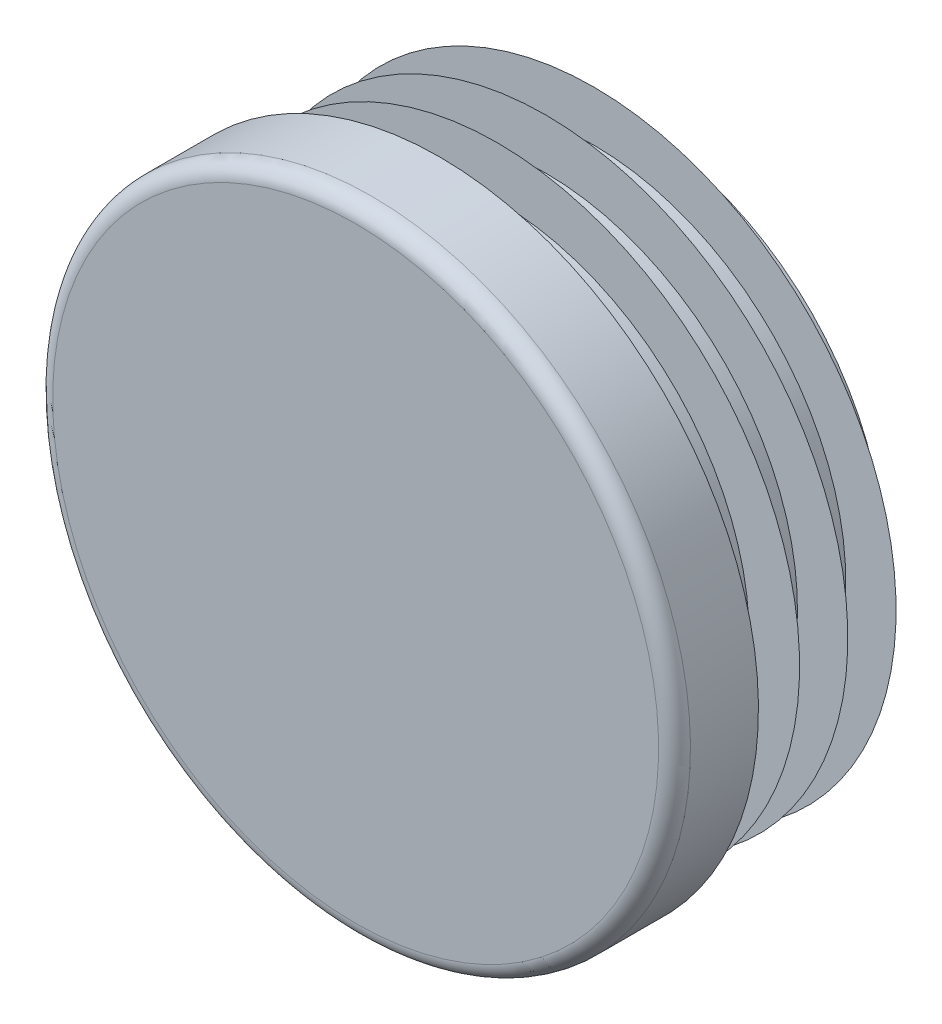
ISO-10303-21;
HEADER;
FILE_DESCRIPTION(('STEP AP214'),'2;1');
FILE_NAME('part.step','',(''),(''),'','','');
FILE_SCHEMA(('AUTOMOTIVE_DESIGN { 1 0 10303 214 1 1 1 1 }'));
ENDSEC;
DATA;
#1=APPLICATION_CONTEXT('core data for automotive mechanical design processes');
#2=APPLICATION_PROTOCOL_DEFINITION('international standard','automotive_design',2000,#1);
#3=PRODUCT_CONTEXT('',#1,'mechanical');
#4=PRODUCT('Part','Part','',(#3));
#5=PRODUCT_RELATED_PRODUCT_CATEGORY('part','',(#4));
#6=PRODUCT_DEFINITION_FORMATION('','',#4);
#7=PRODUCT_DEFINITION_CONTEXT('part definition',#1,'design');
#8=PRODUCT_DEFINITION('design','',#6,#7);
#9=PRODUCT_DEFINITION_SHAPE('','',#8);
#10=(LENGTH_UNIT() NAMED_UNIT(*) SI_UNIT(.MILLI.,.METRE.));
#11=(NAMED_UNIT(*) PLANE_ANGLE_UNIT() SI_UNIT($,.RADIAN.));
#12=(NAMED_UNIT(*) SI_UNIT($,.STERADIAN.) SOLID_ANGLE_UNIT());
#13=UNCERTAINTY_MEASURE_WITH_UNIT(LENGTH_MEASURE(1.E-05),#10,'distance_accuracy_value','');
#14=(GEOMETRIC_REPRESENTATION_CONTEXT(3) GLOBAL_UNCERTAINTY_ASSIGNED_CONTEXT((#13)) GLOBAL_UNIT_ASSIGNED_CONTEXT((#10,
#11,#12)) REPRESENTATION_CONTEXT('',''));
#15=CARTESIAN_POINT('',(0.,0.,0.));
#16=DIRECTION('',(0.,0.,1.));
#17=DIRECTION('',(1.,0.,0.));
#18=AXIS2_PLACEMENT_3D('',#15,#16,#17);
#19=CARTESIAN_POINT('',(0.,0.,5.));
#20=DIRECTION('',(0.,0.,-1.));
#21=DIRECTION('',(0.,1.,0.));
#22=AXIS2_PLACEMENT_3D('',#19,#20,#21);
#23=PLANE('',#22);
#24=CARTESIAN_POINT('',(0.,0.,5.));
#25=DIRECTION('',(0.,0.,-1.));
#26=DIRECTION('',(0.,1.,0.));
#27=AXIS2_PLACEMENT_3D('',#24,#25,#26);
#28=CIRCLE('',#27,18.05);
#29=CARTESIAN_POINT('',(0.,18.05,5.));
#30=VERTEX_POINT('',#29);
#31=EDGE_CURVE('E8',#30,#30,#28,.T.);
#32=ORIENTED_EDGE('',*,*,#31,.F.);
#33=EDGE_LOOP('',(#32));
#34=FACE_BOUND('',#33,.T.);
#35=ADVANCED_FACE('F12',(#34),#23,.F.);
#36=CARTESIAN_POINT('',(0.,0.,4.05));
#37=DIRECTION('',(0.,0.,-1.));
#38=DIRECTION('',(0.,1.,0.));
#39=AXIS2_PLACEMENT_3D('',#36,#37,#38);
#40=TOROIDAL_SURFACE('',#39,18.05,0.95);
#41=ORIENTED_EDGE('',*,*,#31,.T.);
#42=EDGE_LOOP('',(#41));
#43=FACE_BOUND('',#42,.T.);
#44=CARTESIAN_POINT('',(0.,0.,4.05));
#45=DIRECTION('',(0.,0.,-1.));
#46=DIRECTION('',(0.,1.,0.));
#47=AXIS2_PLACEMENT_3D('',#44,#45,#46);
#48=CIRCLE('',#47,19.);
#49=CARTESIAN_POINT('',(0.,19.,4.05));
#50=VERTEX_POINT('',#49);
#51=EDGE_CURVE('E18',#50,#50,#48,.T.);
#52=ORIENTED_EDGE('',*,*,#51,.F.);
#53=EDGE_LOOP('',(#52));
#54=FACE_BOUND('',#53,.T.);
#55=ADVANCED_FACE('F159',(#43,#54),#40,.T.);
#56=CARTESIAN_POINT('',(0.,0.,-11.5));
#57=DIRECTION('',(0.,0.,-1.));
#58=DIRECTION('',(0.,1.,0.));
#59=AXIS2_PLACEMENT_3D('',#56,#57,#58);
#60=CYLINDRICAL_SURFACE('',#59,19.);
#61=CARTESIAN_POINT('',(0.,0.,0.));
#62=DIRECTION('',(0.,0.,-1.));
#63=DIRECTION('',(0.,1.,0.));
#64=AXIS2_PLACEMENT_3D('',#61,#62,#63);
#65=CIRCLE('',#64,19.);
#66=CARTESIAN_POINT('',(0.,19.,0.));
#67=VERTEX_POINT('',#66);
#68=EDGE_CURVE('E22',#67,#67,#65,.T.);
#69=ORIENTED_EDGE('',*,*,#68,.F.);
#70=EDGE_LOOP('',(#69));
#71=FACE_BOUND('',#70,.T.);
#72=ORIENTED_EDGE('',*,*,#51,.T.);
#73=EDGE_LOOP('',(#72));
#74=FACE_BOUND('',#73,.T.);
#75=ADVANCED_FACE('F154',(#71,#74),#60,.T.);
#76=CARTESIAN_POINT('',(19.,0.,0.));
#77=DIRECTION('',(0.,0.,1.));
#78=DIRECTION('',(0.,-1.,0.));
#79=AXIS2_PLACEMENT_3D('',#76,#77,#78);
#80=PLANE('',#79);
#81=CARTESIAN_POINT('',(0.,0.,0.));
#82=DIRECTION('',(0.,0.,-1.));
#83=DIRECTION('',(0.,1.,0.));
#84=AXIS2_PLACEMENT_3D('',#81,#82,#83);
#85=CIRCLE('',#84,15.);
#86=CARTESIAN_POINT('',(0.,15.,0.));
#87=VERTEX_POINT('',#86);
#88=EDGE_CURVE('E26',#87,#87,#85,.T.);
#89=ORIENTED_EDGE('',*,*,#88,.F.);
#90=EDGE_LOOP('',(#89));
#91=FACE_BOUND('',#90,.T.);
#92=ORIENTED_EDGE('',*,*,#68,.T.);
#93=EDGE_LOOP('',(#92));
#94=FACE_BOUND('',#93,.T.);
#95=ADVANCED_FACE('F148',(#91,#94),#80,.F.);
#96=CARTESIAN_POINT('',(0.,0.,-11.5));
#97=DIRECTION('',(0.,0.,-1.));
#98=DIRECTION('',(0.,1.,0.));
#99=AXIS2_PLACEMENT_3D('',#96,#97,#98);
#100=CYLINDRICAL_SURFACE('',#99,15.);
#101=CARTESIAN_POINT('',(0.,0.,-0.575));
#102=DIRECTION('',(0.,0.,-1.));
#103=DIRECTION('',(0.,1.,0.));
#104=AXIS2_PLACEMENT_3D('',#101,#102,#103);
#105=CIRCLE('',#104,15.);
#106=CARTESIAN_POINT('',(0.,15.,-0.575));
#107=VERTEX_POINT('',#106);
#108=EDGE_CURVE('E31',#107,#107,#105,.T.);
#109=ORIENTED_EDGE('',*,*,#108,.F.);
#110=EDGE_LOOP('',(#109));
#111=FACE_BOUND('',#110,.T.);
#112=ORIENTED_EDGE('',*,*,#88,.T.);
#113=EDGE_LOOP('',(#112));
#114=FACE_BOUND('',#113,.T.);
#115=ADVANCED_FACE('F142',(#111,#114),#100,.T.);
#116=CARTESIAN_POINT('',(15.,0.,-0.575));
#117=DIRECTION('',(0.,0.,-1.));
#118=DIRECTION('',(0.,1.,0.));
#119=AXIS2_PLACEMENT_3D('',#116,#117,#118);
#120=PLANE('',#119);
#121=CARTESIAN_POINT('',(0.,0.,-0.575));
#122=DIRECTION('',(0.,0.,-1.));
#123=DIRECTION('',(0.,1.,0.));
#124=AXIS2_PLACEMENT_3D('',#121,#122,#123);
#125=CIRCLE('',#124,18.);
#126=CARTESIAN_POINT('',(0.,18.,-0.575));
#127=VERTEX_POINT('',#126);
#128=EDGE_CURVE('E34',#127,#127,#125,.T.);
#129=ORIENTED_EDGE('',*,*,#128,.F.);
#130=EDGE_LOOP('',(#129));
#131=FACE_BOUND('',#130,.T.);
#132=ORIENTED_EDGE('',*,*,#108,.T.);
#133=EDGE_LOOP('',(#132));
#134=FACE_BOUND('',#133,.T.);
#135=ADVANCED_FACE('F136',(#131,#134),#120,.F.);
#136=CARTESIAN_POINT('',(0.,0.,-0.575));
#137=DIRECTION('',(0.,0.,1.));
#138=DIRECTION('',(0.,-1.,0.));
#139=AXIS2_PLACEMENT_3D('',#136,#137,#138);
#140=CONICAL_SURFACE('',#139,18.,0.959931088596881);
#141=CARTESIAN_POINT('',(0.,0.,-2.67562261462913));
#142=DIRECTION('',(0.,0.,-1.));
#143=DIRECTION('',(0.,1.,0.));
#144=AXIS2_PLACEMENT_3D('',#141,#142,#143);
#145=CIRCLE('',#144,15.);
#146=CARTESIAN_POINT('',(0.,15.,-2.67562261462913));
#147=VERTEX_POINT('',#146);
#148=EDGE_CURVE('E37',#147,#147,#145,.T.);
#149=ORIENTED_EDGE('',*,*,#148,.F.);
#150=EDGE_LOOP('',(#149));
#151=FACE_BOUND('',#150,.T.);
#152=ORIENTED_EDGE('',*,*,#128,.T.);
#153=EDGE_LOOP('',(#152));
#154=FACE_BOUND('',#153,.T.);
#155=ADVANCED_FACE('F130',(#151,#154),#140,.T.);
#156=CARTESIAN_POINT('',(0.,0.,-11.5));
#157=DIRECTION('',(0.,0.,-1.));
#158=DIRECTION('',(0.,1.,0.));
#159=AXIS2_PLACEMENT_3D('',#156,#157,#158);
#160=CYLINDRICAL_SURFACE('',#159,15.);
#161=CARTESIAN_POINT('',(0.,0.,-3.45));
#162=DIRECTION('',(0.,0.,-1.));
#163=DIRECTION('',(0.,1.,0.));
#164=AXIS2_PLACEMENT_3D('',#161,#162,#163);
#165=CIRCLE('',#164,15.);
#166=CARTESIAN_POINT('',(0.,15.,-3.45));
#167=VERTEX_POINT('',#166);
#168=EDGE_CURVE('E40',#167,#167,#165,.T.);
#169=ORIENTED_EDGE('',*,*,#168,.F.);
#170=EDGE_LOOP('',(#169));
#171=FACE_BOUND('',#170,.T.);
#172=ORIENTED_EDGE('',*,*,#148,.T.);
#173=EDGE_LOOP('',(#172));
#174=FACE_BOUND('',#173,.T.);
#175=ADVANCED_FACE('F124',(#171,#174),#160,.T.);
#176=CARTESIAN_POINT('',(15.,0.,-3.45));
#177=DIRECTION('',(0.,0.,-1.));
#178=DIRECTION('',(0.,1.,0.));
#179=AXIS2_PLACEMENT_3D('',#176,#177,#178);
#180=PLANE('',#179);
#181=CARTESIAN_POINT('',(0.,0.,-3.45));
#182=DIRECTION('',(0.,0.,-1.));
#183=DIRECTION('',(0.,1.,0.));
#184=AXIS2_PLACEMENT_3D('',#181,#182,#183);
#185=CIRCLE('',#184,18.);
#186=CARTESIAN_POINT('',(0.,18.,-3.45));
#187=VERTEX_POINT('',#186);
#188=EDGE_CURVE('E43',#187,#187,#185,.T.);
#189=ORIENTED_EDGE('',*,*,#188,.F.);
#190=EDGE_LOOP('',(#189));
#191=FACE_BOUND('',#190,.T.);
#192=ORIENTED_EDGE('',*,*,#168,.T.);
#193=EDGE_LOOP('',(#192));
#194=FACE_BOUND('',#193,.T.);
#195=ADVANCED_FACE('F118',(#191,#194),#180,.F.);
#196=CARTESIAN_POINT('',(0.,0.,-3.45));
#197=DIRECTION('',(0.,0.,1.));
#198=DIRECTION('',(0.,-1.,0.));
#199=AXIS2_PLACEMENT_3D('',#196,#197,#198);
#200=CONICAL_SURFACE('',#199,18.,0.959931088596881);
#201=CARTESIAN_POINT('',(0.,0.,-5.55062261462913));
#202=DIRECTION('',(0.,0.,-1.));
#203=DIRECTION('',(0.,1.,0.));
#204=AXIS2_PLACEMENT_3D('',#201,#202,#203);
#205=CIRCLE('',#204,15.);
#206=CARTESIAN_POINT('',(0.,15.,-5.55062261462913));
#207=VERTEX_POINT('',#206);
#208=EDGE_CURVE('E46',#207,#207,#205,.T.);
#209=ORIENTED_EDGE('',*,*,#208,.F.);
#210=EDGE_LOOP('',(#209));
#211=FACE_BOUND('',#210,.T.);
#212=ORIENTED_EDGE('',*,*,#188,.T.);
#213=EDGE_LOOP('',(#212));
#214=FACE_BOUND('',#213,.T.);
#215=ADVANCED_FACE('F112',(#211,#214),#200,.T.);
#216=CARTESIAN_POINT('',(0.,0.,-11.5));
#217=DIRECTION('',(0.,0.,-1.));
#218=DIRECTION('',(0.,1.,0.));
#219=AXIS2_PLACEMENT_3D('',#216,#217,#218);
#220=CYLINDRICAL_SURFACE('',#219,15.);
#221=CARTESIAN_POINT('',(0.,0.,-6.325));
#222=DIRECTION('',(0.,0.,-1.));
#223=DIRECTION('',(0.,1.,0.));
#224=AXIS2_PLACEMENT_3D('',#221,#222,#223);
#225=CIRCLE('',#224,15.);
#226=CARTESIAN_POINT('',(0.,15.,-6.325));
#227=VERTEX_POINT('',#226);
#228=EDGE_CURVE('E49',#227,#227,#225,.T.);
#229=ORIENTED_EDGE('',*,*,#228,.F.);
#230=EDGE_LOOP('',(#229));
#231=FACE_BOUND('',#230,.T.);
#232=ORIENTED_EDGE('',*,*,#208,.T.);
#233=EDGE_LOOP('',(#232));
#234=FACE_BOUND('',#233,.T.);
#235=ADVANCED_FACE('F106',(#231,#234),#220,.T.);
#236=CARTESIAN_POINT('',(15.,0.,-6.325));
#237=DIRECTION('',(0.,0.,-1.));
#238=DIRECTION('',(0.,1.,0.));
#239=AXIS2_PLACEMENT_3D('',#236,#237,#238);
#240=PLANE('',#239);
#241=CARTESIAN_POINT('',(0.,0.,-6.325));
#242=DIRECTION('',(0.,0.,-1.));
#243=DIRECTION('',(0.,1.,0.));
#244=AXIS2_PLACEMENT_3D('',#241,#242,#243);
#245=CIRCLE('',#244,18.);
#246=CARTESIAN_POINT('',(0.,18.,-6.325));
#247=VERTEX_POINT('',#246);
#248=EDGE_CURVE('E52',#247,#247,#245,.T.);
#249=ORIENTED_EDGE('',*,*,#248,.F.);
#250=EDGE_LOOP('',(#249));
#251=FACE_BOUND('',#250,.T.);
#252=ORIENTED_EDGE('',*,*,#228,.T.);
#253=EDGE_LOOP('',(#252));
#254=FACE_BOUND('',#253,.T.);
#255=ADVANCED_FACE('F100',(#251,#254),#240,.F.);
#256=CARTESIAN_POINT('',(0.,0.,-6.325));
#257=DIRECTION('',(0.,0.,1.));
#258=DIRECTION('',(0.,-1.,0.));
#259=AXIS2_PLACEMENT_3D('',#256,#257,#258);
#260=CONICAL_SURFACE('',#259,18.,0.959931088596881);
#261=CARTESIAN_POINT('',(0.,0.,-8.42562261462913));
#262=DIRECTION('',(0.,0.,-1.));
#263=DIRECTION('',(0.,1.,0.));
#264=AXIS2_PLACEMENT_3D('',#261,#262,#263);
#265=CIRCLE('',#264,15.);
#266=CARTESIAN_POINT('',(0.,15.,-8.42562261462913));
#267=VERTEX_POINT('',#266);
#268=EDGE_CURVE('E55',#267,#267,#265,.T.);
#269=ORIENTED_EDGE('',*,*,#268,.F.);
#270=EDGE_LOOP('',(#269));
#271=FACE_BOUND('',#270,.T.);
#272=ORIENTED_EDGE('',*,*,#248,.T.);
#273=EDGE_LOOP('',(#272));
#274=FACE_BOUND('',#273,.T.);
#275=ADVANCED_FACE('F94',(#271,#274),#260,.T.);
#276=CARTESIAN_POINT('',(0.,0.,-11.5));
#277=DIRECTION('',(0.,0.,-1.));
#278=DIRECTION('',(0.,1.,0.));
#279=AXIS2_PLACEMENT_3D('',#276,#277,#278);
#280=CYLINDRICAL_SURFACE('',#279,15.);
#281=CARTESIAN_POINT('',(0.,0.,-9.2));
#282=DIRECTION('',(0.,0.,-1.));
#283=DIRECTION('',(0.,1.,0.));
#284=AXIS2_PLACEMENT_3D('',#281,#282,#283);
#285=CIRCLE('',#284,15.);
#286=CARTESIAN_POINT('',(0.,15.,-9.2));
#287=VERTEX_POINT('',#286);
#288=EDGE_CURVE('E58',#287,#287,#285,.T.);
#289=ORIENTED_EDGE('',*,*,#288,.F.);
#290=EDGE_LOOP('',(#289));
#291=FACE_BOUND('',#290,.T.);
#292=ORIENTED_EDGE('',*,*,#268,.T.);
#293=EDGE_LOOP('',(#292));
#294=FACE_BOUND('',#293,.T.);
#295=ADVANCED_FACE('F88',(#291,#294),#280,.T.);
#296=CARTESIAN_POINT('',(15.,0.,-9.2));
#297=DIRECTION('',(0.,0.,-1.));
#298=DIRECTION('',(0.,1.,0.));
#299=AXIS2_PLACEMENT_3D('',#296,#297,#298);
#300=PLANE('',#299);
#301=CARTESIAN_POINT('',(0.,0.,-9.2));
#302=DIRECTION('',(0.,0.,-1.));
#303=DIRECTION('',(0.,1.,0.));
#304=AXIS2_PLACEMENT_3D('',#301,#302,#303);
#305=CIRCLE('',#304,18.);
#306=CARTESIAN_POINT('',(0.,18.,-9.2));
#307=VERTEX_POINT('',#306);
#308=EDGE_CURVE('E61',#307,#307,#305,.T.);
#309=ORIENTED_EDGE('',*,*,#308,.F.);
#310=EDGE_LOOP('',(#309));
#311=FACE_BOUND('',#310,.T.);
#312=ORIENTED_EDGE('',*,*,#288,.T.);
#313=EDGE_LOOP('',(#312));
#314=FACE_BOUND('',#313,.T.);
#315=ADVANCED_FACE('F82',(#311,#314),#300,.F.);
#316=CARTESIAN_POINT('',(0.,0.,-9.2));
#317=DIRECTION('',(0.,0.,1.));
#318=DIRECTION('',(0.,-1.,0.));
#319=AXIS2_PLACEMENT_3D('',#316,#317,#318);
#320=CONICAL_SURFACE('',#319,18.,0.959931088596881);
#321=CARTESIAN_POINT('',(0.,0.,-11.3006226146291));
#322=DIRECTION('',(0.,0.,-1.));
#323=DIRECTION('',(0.,1.,0.));
#324=AXIS2_PLACEMENT_3D('',#321,#322,#323);
#325=CIRCLE('',#324,15.);
#326=CARTESIAN_POINT('',(0.,15.,-11.3006226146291));
#327=VERTEX_POINT('',#326);
#328=EDGE_CURVE('E64',#327,#327,#325,.T.);
#329=ORIENTED_EDGE('',*,*,#328,.F.);
#330=EDGE_LOOP('',(#329));
#331=FACE_BOUND('',#330,.T.);
#332=ORIENTED_EDGE('',*,*,#308,.T.);
#333=EDGE_LOOP('',(#332));
#334=FACE_BOUND('',#333,.T.);
#335=ADVANCED_FACE('F76',(#331,#334),#320,.T.);
#336=CARTESIAN_POINT('',(0.,0.,-11.5));
#337=DIRECTION('',(0.,0.,-1.));
#338=DIRECTION('',(0.,1.,0.));
#339=AXIS2_PLACEMENT_3D('',#336,#337,#338);
#340=CYLINDRICAL_SURFACE('',#339,15.);
#341=CARTESIAN_POINT('',(0.,0.,-11.5));
#342=DIRECTION('',(0.,0.,-1.));
#343=DIRECTION('',(0.,1.,0.));
#344=AXIS2_PLACEMENT_3D('',#341,#342,#343);
#345=CIRCLE('',#344,15.);
#346=CARTESIAN_POINT('',(0.,15.,-11.5));
#347=VERTEX_POINT('',#346);
#348=EDGE_CURVE('E67',#347,#347,#345,.T.);
#349=ORIENTED_EDGE('',*,*,#348,.F.);
#350=EDGE_LOOP('',(#349));
#351=FACE_BOUND('',#350,.T.);
#352=ORIENTED_EDGE('',*,*,#328,.T.);
#353=EDGE_LOOP('',(#352));
#354=FACE_BOUND('',#353,.T.);
#355=ADVANCED_FACE('F73',(#351,#354),#340,.T.);
#356=CARTESIAN_POINT('',(15.,0.,-11.5));
#357=DIRECTION('',(0.,0.,1.));
#358=DIRECTION('',(0.,-1.,0.));
#359=AXIS2_PLACEMENT_3D('',#356,#357,#358);
#360=PLANE('',#359);
#361=ORIENTED_EDGE('',*,*,#348,.T.);
#362=EDGE_LOOP('',(#361));
#363=FACE_BOUND('',#362,.T.);
#364=ADVANCED_FACE('F71',(#363),#360,.F.);
#365=CLOSED_SHELL('',(#35,#55,#75,#95,#115,#135,#155,#175,#195,#215,#235,#255,#275,#295,#315,
#335,#355,#364));
#366=MANIFOLD_SOLID_BREP('B1',#365);
#367=ADVANCED_BREP_SHAPE_REPRESENTATION('',(#18,#366),#14);
#368=SHAPE_DEFINITION_REPRESENTATION(#9,#367);
ENDSEC;
END-ISO-10303-21;
